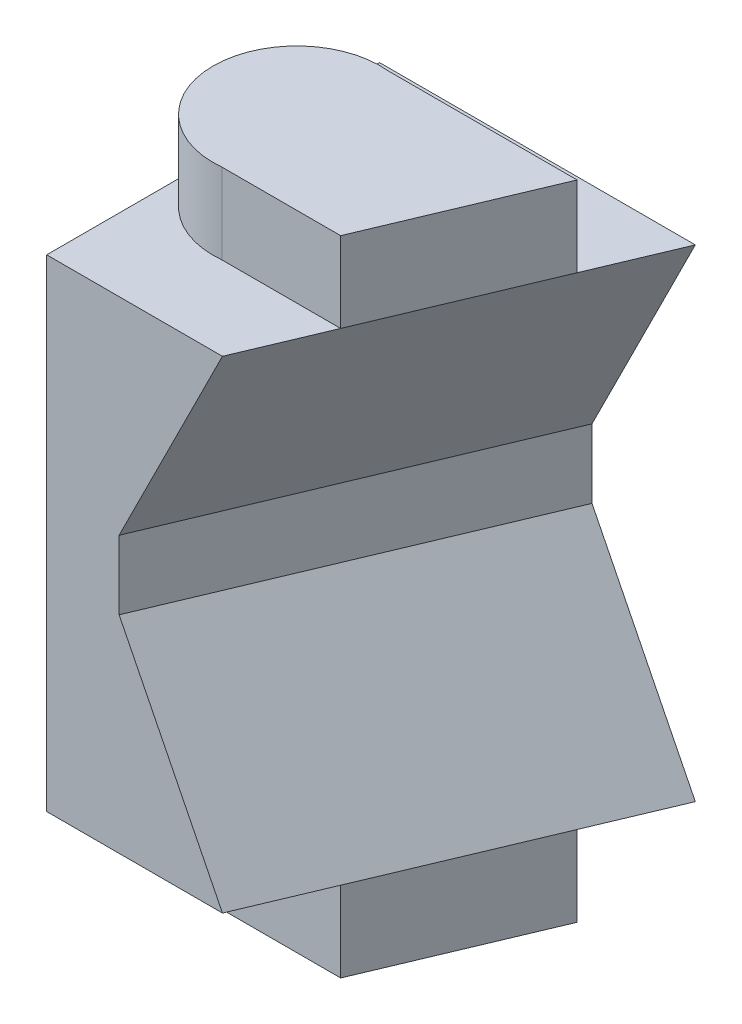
ISO-10303-21;
HEADER;
FILE_DESCRIPTION(('STEP AP214'),'2;1');
FILE_NAME('part.step','',(''),(''),'','','');
FILE_SCHEMA(('AUTOMOTIVE_DESIGN { 1 0 10303 214 1 1 1 1 }'));
ENDSEC;
DATA;
#1=APPLICATION_CONTEXT('core data for automotive mechanical design processes');
#2=APPLICATION_PROTOCOL_DEFINITION('international standard','automotive_design',2000,#1);
#3=PRODUCT_CONTEXT('',#1,'mechanical');
#4=PRODUCT('Part','Part','',(#3));
#5=PRODUCT_RELATED_PRODUCT_CATEGORY('part','',(#4));
#6=PRODUCT_DEFINITION_FORMATION('','',#4);
#7=PRODUCT_DEFINITION_CONTEXT('part definition',#1,'design');
#8=PRODUCT_DEFINITION('design','',#6,#7);
#9=PRODUCT_DEFINITION_SHAPE('','',#8);
#10=(LENGTH_UNIT() NAMED_UNIT(*) SI_UNIT(.MILLI.,.METRE.));
#11=(NAMED_UNIT(*) PLANE_ANGLE_UNIT() SI_UNIT($,.RADIAN.));
#12=(NAMED_UNIT(*) SI_UNIT($,.STERADIAN.) SOLID_ANGLE_UNIT());
#13=UNCERTAINTY_MEASURE_WITH_UNIT(LENGTH_MEASURE(1.E-05),#10,'distance_accuracy_value','');
#14=(GEOMETRIC_REPRESENTATION_CONTEXT(3) GLOBAL_UNCERTAINTY_ASSIGNED_CONTEXT((#13)) GLOBAL_UNIT_ASSIGNED_CONTEXT((#10,
#11,#12)) REPRESENTATION_CONTEXT('',''));
#15=CARTESIAN_POINT('',(0.,0.,0.));
#16=DIRECTION('',(0.,0.,1.));
#17=DIRECTION('',(1.,0.,0.));
#18=AXIS2_PLACEMENT_3D('',#15,#16,#17);
#19=CARTESIAN_POINT('',(27.5,-21.0000000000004,0.));
#20=DIRECTION('',(0.,1.00000000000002,0.));
#21=DIRECTION('',(0.,0.,1.00000000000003));
#22=AXIS2_PLACEMENT_3D('',#19,#20,#21);
#23=PLANE('',#22);
#24=CARTESIAN_POINT('',(7.2856942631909,-21.0000000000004,14.5000000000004));
#25=DIRECTION('',(0.,1.,0.));
#26=DIRECTION('',(0.,0.,-1.));
#27=AXIS2_PLACEMENT_3D('',#24,#25,#26);
#28=CIRCLE('',#27,7.28569426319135);
#29=CARTESIAN_POINT('',(-4.5102810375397E-13,-21.0000000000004,14.5000000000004));
#30=VERTEX_POINT('',#29);
#31=CARTESIAN_POINT('',(8.00600037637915,-21.0000000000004,21.7500000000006));
#32=VERTEX_POINT('',#31);
#33=EDGE_CURVE('E9',#30,#32,#28,.T.);
#34=ORIENTED_EDGE('',*,*,#33,.T.);
#35=DIRECTION('',(1.,0.,0.));
#36=VECTOR('',#35,1.);
#37=CARTESIAN_POINT('',(8.00600037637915,-21.0000000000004,21.7500000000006));
#38=LINE('',#37,#36);
#39=CARTESIAN_POINT('',(18.3571418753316,-21.0000000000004,21.7500000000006));
#40=VERTEX_POINT('',#39);
#41=EDGE_CURVE('E166',#32,#40,#38,.T.);
#42=ORIENTED_EDGE('',*,*,#41,.T.);
#43=DIRECTION('',(0.387515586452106,0.,-0.921863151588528));
#44=VECTOR('',#43,1.);
#45=CARTESIAN_POINT('',(15.3095225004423,-21.0000000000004,29.0000000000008));
#46=LINE('',#45,#44);
#47=CARTESIAN_POINT('',(15.3095225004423,-21.0000000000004,29.0000000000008));
#48=VERTEX_POINT('',#47);
#49=EDGE_CURVE('E209',#48,#40,#46,.T.);
#50=ORIENTED_EDGE('',*,*,#49,.F.);
#51=DIRECTION('',(1.00000000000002,0.,0.));
#52=VECTOR('',#51,1.);
#53=CARTESIAN_POINT('',(-4.5102810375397E-13,-21.0000000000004,29.0000000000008));
#54=LINE('',#53,#52);
#55=CARTESIAN_POINT('',(0.,-21.0000000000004,29.0000000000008));
#56=VERTEX_POINT('',#55);
#57=EDGE_CURVE('E208',#56,#48,#54,.T.);
#58=ORIENTED_EDGE('',*,*,#57,.F.);
#59=DIRECTION('',(0.,0.,-1.));
#60=VECTOR('',#59,1.);
#61=CARTESIAN_POINT('',(0.,-21.0000000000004,14.5000000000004));
#62=LINE('',#61,#60);
#63=EDGE_CURVE('E130',#56,#30,#62,.T.);
#64=ORIENTED_EDGE('',*,*,#63,.T.);
#65=EDGE_LOOP('',(#34,#42,#50,#58,#64));
#66=FACE_BOUND('',#65,.T.);
#67=ADVANCED_FACE('F14',(#66),#23,.F.);
#68=CARTESIAN_POINT('',(-4.5102810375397E-13,21.0000000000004,29.0000000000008));
#69=DIRECTION('',(0.,1.00000000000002,0.));
#70=DIRECTION('',(0.,0.,1.00000000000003));
#71=AXIS2_PLACEMENT_3D('',#68,#69,#70);
#72=PLANE('',#71);
#73=DIRECTION('',(-1.,0.,0.));
#74=VECTOR('',#73,1.);
#75=CARTESIAN_POINT('',(8.00600037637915,21.0000000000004,7.2500000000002));
#76=LINE('',#75,#74);
#77=CARTESIAN_POINT('',(24.452380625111,21.0000000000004,7.24999999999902));
#78=VERTEX_POINT('',#77);
#79=CARTESIAN_POINT('',(8.00600037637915,21.0000000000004,7.2500000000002));
#80=VERTEX_POINT('',#79);
#81=EDGE_CURVE('E186',#78,#80,#76,.T.);
#82=ORIENTED_EDGE('',*,*,#81,.F.);
#83=DIRECTION('',(0.387515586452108,0.,-0.921863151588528));
#84=VECTOR('',#83,1.);
#85=CARTESIAN_POINT('',(15.3095225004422,21.0000000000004,29.0000000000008));
#86=LINE('',#85,#84);
#87=CARTESIAN_POINT('',(27.5,21.0000000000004,0.));
#88=VERTEX_POINT('',#87);
#89=EDGE_CURVE('E224',#78,#88,#86,.T.);
#90=ORIENTED_EDGE('',*,*,#89,.T.);
#91=DIRECTION('',(-1.00000000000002,0.,0.));
#92=VECTOR('',#91,1.);
#93=CARTESIAN_POINT('',(27.5,21.0000000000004,0.));
#94=LINE('',#93,#92);
#95=CARTESIAN_POINT('',(0.,21.0000000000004,0.));
#96=VERTEX_POINT('',#95);
#97=EDGE_CURVE('E125',#88,#96,#94,.T.);
#98=ORIENTED_EDGE('',*,*,#97,.T.);
#99=DIRECTION('',(0.,0.,1.));
#100=VECTOR('',#99,1.);
#101=CARTESIAN_POINT('',(0.,21.0000000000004,14.5000000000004));
#102=LINE('',#101,#100);
#103=CARTESIAN_POINT('',(0.,21.0000000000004,14.5000000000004));
#104=VERTEX_POINT('',#103);
#105=EDGE_CURVE('E122',#96,#104,#102,.T.);
#106=ORIENTED_EDGE('',*,*,#105,.T.);
#107=CARTESIAN_POINT('',(7.2856942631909,21.0000000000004,14.5000000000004));
#108=DIRECTION('',(0.,1.,0.));
#109=DIRECTION('',(0.,0.,-1.));
#110=AXIS2_PLACEMENT_3D('',#107,#108,#109);
#111=CIRCLE('',#110,7.28569426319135);
#112=EDGE_CURVE('E39',#80,#104,#111,.T.);
#113=ORIENTED_EDGE('',*,*,#112,.F.);
#114=EDGE_LOOP('',(#82,#90,#98,#106,#113));
#115=FACE_BOUND('',#114,.T.);
#116=ADVANCED_FACE('F123',(#115),#72,.T.);
#117=CARTESIAN_POINT('',(8.00600037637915,21.0000000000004,21.7500000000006));
#118=VERTEX_POINT('',#117);
#119=EDGE_CURVE('E23',#104,#118,#111,.T.);
#120=ORIENTED_EDGE('',*,*,#119,.F.);
#121=DIRECTION('',(0.,0.,1.));
#122=VECTOR('',#121,1.);
#123=CARTESIAN_POINT('',(0.,21.0000000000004,14.5000000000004));
#124=LINE('',#123,#122);
#125=CARTESIAN_POINT('',(0.,21.0000000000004,29.0000000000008));
#126=VERTEX_POINT('',#125);
#127=EDGE_CURVE('E149',#104,#126,#124,.T.);
#128=ORIENTED_EDGE('',*,*,#127,.T.);
#129=DIRECTION('',(1.00000000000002,0.,0.));
#130=VECTOR('',#129,1.);
#131=CARTESIAN_POINT('',(-4.5102810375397E-13,21.0000000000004,29.0000000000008));
#132=LINE('',#131,#130);
#133=CARTESIAN_POINT('',(15.3095225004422,21.0000000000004,29.0000000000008));
#134=VERTEX_POINT('',#133);
#135=EDGE_CURVE('E220',#126,#134,#132,.T.);
#136=ORIENTED_EDGE('',*,*,#135,.T.);
#137=CARTESIAN_POINT('',(18.3571418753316,21.0000000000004,21.7500000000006));
#138=VERTEX_POINT('',#137);
#139=EDGE_CURVE('E223',#134,#138,#86,.T.);
#140=ORIENTED_EDGE('',*,*,#139,.T.);
#141=DIRECTION('',(1.,0.,0.));
#142=VECTOR('',#141,1.);
#143=CARTESIAN_POINT('',(8.00600037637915,21.0000000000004,21.7500000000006));
#144=LINE('',#143,#142);
#145=EDGE_CURVE('E143',#118,#138,#144,.T.);
#146=ORIENTED_EDGE('',*,*,#145,.F.);
#147=EDGE_LOOP('',(#120,#128,#136,#140,#146));
#148=FACE_BOUND('',#147,.T.);
#149=ADVANCED_FACE('F148',(#148),#72,.T.);
#150=CARTESIAN_POINT('',(-4.5102810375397E-13,3.00000000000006,29.0000000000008));
#151=DIRECTION('',(0.,0.,1.00000000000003));
#152=DIRECTION('',(1.00000000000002,0.,0.));
#153=AXIS2_PLACEMENT_3D('',#150,#151,#152);
#154=PLANE('',#153);
#155=ORIENTED_EDGE('',*,*,#135,.F.);
#156=DIRECTION('',(0.,-1.,0.));
#157=VECTOR('',#156,1.);
#158=CARTESIAN_POINT('',(0.,21.0000000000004,29.0000000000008));
#159=LINE('',#158,#157);
#160=EDGE_CURVE('E156',#126,#56,#159,.T.);
#161=ORIENTED_EDGE('',*,*,#160,.T.);
#162=ORIENTED_EDGE('',*,*,#57,.T.);
#163=DIRECTION('',(-0.447213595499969,0.894427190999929,0.));
#164=VECTOR('',#163,1.);
#165=CARTESIAN_POINT('',(15.3095225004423,-21.0000000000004,29.0000000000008));
#166=LINE('',#165,#164);
#167=CARTESIAN_POINT('',(6.309522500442,-3.00000000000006,29.0000000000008));
#168=VERTEX_POINT('',#167);
#169=EDGE_CURVE('E202',#48,#168,#166,.T.);
#170=ORIENTED_EDGE('',*,*,#169,.T.);
#171=DIRECTION('',(0.,1.00000000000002,0.));
#172=VECTOR('',#171,1.);
#173=CARTESIAN_POINT('',(6.309522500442,-3.00000000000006,29.0000000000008));
#174=LINE('',#173,#172);
#175=CARTESIAN_POINT('',(6.309522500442,3.00000000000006,29.0000000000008));
#176=VERTEX_POINT('',#175);
#177=EDGE_CURVE('E216',#168,#176,#174,.T.);
#178=ORIENTED_EDGE('',*,*,#177,.T.);
#179=DIRECTION('',(0.447213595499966,0.894427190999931,0.));
#180=VECTOR('',#179,1.);
#181=CARTESIAN_POINT('',(6.309522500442,3.00000000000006,29.0000000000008));
#182=LINE('',#181,#180);
#183=EDGE_CURVE('E229',#176,#134,#182,.T.);
#184=ORIENTED_EDGE('',*,*,#183,.T.);
#185=EDGE_LOOP('',(#155,#161,#162,#170,#178,#184));
#186=FACE_BOUND('',#185,.T.);
#187=ADVANCED_FACE('F16',(#186),#154,.T.);
#188=CARTESIAN_POINT('',(18.5,3.00000000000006,0.));
#189=DIRECTION('',(0.,0.,-1.00000000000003));
#190=DIRECTION('',(-1.00000000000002,0.,0.));
#191=AXIS2_PLACEMENT_3D('',#188,#189,#190);
#192=PLANE('',#191);
#193=DIRECTION('',(-1.00000000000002,0.,0.));
#194=VECTOR('',#193,1.);
#195=CARTESIAN_POINT('',(27.5,-21.0000000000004,0.));
#196=LINE('',#195,#194);
#197=CARTESIAN_POINT('',(27.5,-21.0000000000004,0.));
#198=VERTEX_POINT('',#197);
#199=CARTESIAN_POINT('',(0.,-21.0000000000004,0.));
#200=VERTEX_POINT('',#199);
#201=EDGE_CURVE('E206',#198,#200,#196,.T.);
#202=ORIENTED_EDGE('',*,*,#201,.T.);
#203=DIRECTION('',(0.,1.,0.));
#204=VECTOR('',#203,1.);
#205=CARTESIAN_POINT('',(0.,-21.0000000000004,0.));
#206=LINE('',#205,#204);
#207=EDGE_CURVE('E280',#200,#96,#206,.T.);
#208=ORIENTED_EDGE('',*,*,#207,.T.);
#209=ORIENTED_EDGE('',*,*,#97,.F.);
#210=DIRECTION('',(0.447213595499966,0.894427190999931,0.));
#211=VECTOR('',#210,1.);
#212=CARTESIAN_POINT('',(18.5,3.00000000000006,0.));
#213=LINE('',#212,#211);
#214=CARTESIAN_POINT('',(18.5,3.00000000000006,0.));
#215=VERTEX_POINT('',#214);
#216=EDGE_CURVE('E222',#215,#88,#213,.T.);
#217=ORIENTED_EDGE('',*,*,#216,.F.);
#218=DIRECTION('',(0.,1.00000000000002,0.));
#219=VECTOR('',#218,1.);
#220=CARTESIAN_POINT('',(18.5,-3.00000000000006,0.));
#221=LINE('',#220,#219);
#222=CARTESIAN_POINT('',(18.5,-3.00000000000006,0.));
#223=VERTEX_POINT('',#222);
#224=EDGE_CURVE('E218',#223,#215,#221,.T.);
#225=ORIENTED_EDGE('',*,*,#224,.F.);
#226=DIRECTION('',(-0.447213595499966,0.894427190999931,0.));
#227=VECTOR('',#226,1.);
#228=CARTESIAN_POINT('',(27.5,-21.0000000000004,0.));
#229=LINE('',#228,#227);
#230=EDGE_CURVE('E198',#198,#223,#229,.T.);
#231=ORIENTED_EDGE('',*,*,#230,.F.);
#232=EDGE_LOOP('',(#202,#208,#209,#217,#225,#231));
#233=FACE_BOUND('',#232,.T.);
#234=ADVANCED_FACE('F272',(#233),#192,.T.);
#235=DIRECTION('',(-1.,0.,0.));
#236=VECTOR('',#235,1.);
#237=CARTESIAN_POINT('',(8.00600037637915,-21.0000000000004,7.2500000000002));
#238=LINE('',#237,#236);
#239=CARTESIAN_POINT('',(24.4523806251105,-21.0000000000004,7.2500000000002));
#240=VERTEX_POINT('',#239);
#241=CARTESIAN_POINT('',(8.00600037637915,-21.0000000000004,7.2500000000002));
#242=VERTEX_POINT('',#241);
#243=EDGE_CURVE('E158',#240,#242,#238,.T.);
#244=ORIENTED_EDGE('',*,*,#243,.T.);
#245=EDGE_CURVE('E25',#242,#30,#28,.T.);
#246=ORIENTED_EDGE('',*,*,#245,.T.);
#247=DIRECTION('',(0.,0.,-1.));
#248=VECTOR('',#247,1.);
#249=CARTESIAN_POINT('',(0.,-21.0000000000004,14.5000000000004));
#250=LINE('',#249,#248);
#251=EDGE_CURVE('E131',#30,#200,#250,.T.);
#252=ORIENTED_EDGE('',*,*,#251,.T.);
#253=ORIENTED_EDGE('',*,*,#201,.F.);
#254=EDGE_CURVE('E205',#240,#198,#46,.T.);
#255=ORIENTED_EDGE('',*,*,#254,.F.);
#256=EDGE_LOOP('',(#244,#246,#252,#253,#255));
#257=FACE_BOUND('',#256,.T.);
#258=ADVANCED_FACE('F268',(#257),#23,.F.);
#259=CARTESIAN_POINT('',(6.309522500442,3.00000000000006,29.0000000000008));
#260=DIRECTION('',(0.837207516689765,-0.418603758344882,0.351929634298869));
#261=DIRECTION('',(0.447213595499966,0.894427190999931,0.));
#262=AXIS2_PLACEMENT_3D('',#259,#260,#261);
#263=PLANE('',#262);
#264=DIRECTION('',(0.387515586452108,0.,-0.921863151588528));
#265=VECTOR('',#264,1.);
#266=CARTESIAN_POINT('',(6.309522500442,3.00000000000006,29.0000000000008));
#267=LINE('',#266,#265);
#268=EDGE_CURVE('E152',#176,#215,#267,.T.);
#269=ORIENTED_EDGE('',*,*,#268,.T.);
#270=ORIENTED_EDGE('',*,*,#216,.T.);
#271=ORIENTED_EDGE('',*,*,#89,.F.);
#272=DIRECTION('',(0.387515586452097,0.,-0.921863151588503));
#273=VECTOR('',#272,1.);
#274=CARTESIAN_POINT('',(18.3571418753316,21.0000000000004,21.7500000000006));
#275=LINE('',#274,#273);
#276=EDGE_CURVE('E193',#138,#78,#275,.T.);
#277=ORIENTED_EDGE('',*,*,#276,.F.);
#278=ORIENTED_EDGE('',*,*,#139,.F.);
#279=ORIENTED_EDGE('',*,*,#183,.F.);
#280=EDGE_LOOP('',(#269,#270,#271,#277,#278,#279));
#281=FACE_BOUND('',#280,.T.);
#282=ADVANCED_FACE('F306',(#281),#263,.T.);
#283=CARTESIAN_POINT('',(18.5,-3.00000000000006,0.));
#284=DIRECTION('',(-0.921863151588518,0.,-0.387515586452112));
#285=DIRECTION('',(-0.387515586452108,0.,0.921863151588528));
#286=AXIS2_PLACEMENT_3D('',#283,#284,#285);
#287=PLANE('',#286);
#288=ORIENTED_EDGE('',*,*,#177,.F.);
#289=DIRECTION('',(-0.387515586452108,0.,0.921863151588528));
#290=VECTOR('',#289,1.);
#291=CARTESIAN_POINT('',(18.5,-3.00000000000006,0.));
#292=LINE('',#291,#290);
#293=EDGE_CURVE('E211',#223,#168,#292,.T.);
#294=ORIENTED_EDGE('',*,*,#293,.F.);
#295=ORIENTED_EDGE('',*,*,#224,.T.);
#296=ORIENTED_EDGE('',*,*,#268,.F.);
#297=EDGE_LOOP('',(#288,#294,#295,#296));
#298=FACE_BOUND('',#297,.T.);
#299=ADVANCED_FACE('F276',(#298),#287,.F.);
#300=CARTESIAN_POINT('',(15.3095225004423,-21.0000000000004,29.0000000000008));
#301=DIRECTION('',(0.837207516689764,0.418603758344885,0.351929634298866));
#302=DIRECTION('',(-0.447213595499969,0.894427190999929,0.));
#303=AXIS2_PLACEMENT_3D('',#300,#301,#302);
#304=PLANE('',#303);
#305=ORIENTED_EDGE('',*,*,#49,.T.);
#306=DIRECTION('',(0.387515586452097,0.,-0.921863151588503));
#307=VECTOR('',#306,1.);
#308=CARTESIAN_POINT('',(18.3571418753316,-21.0000000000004,21.7500000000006));
#309=LINE('',#308,#307);
#310=EDGE_CURVE('E178',#40,#240,#309,.T.);
#311=ORIENTED_EDGE('',*,*,#310,.T.);
#312=ORIENTED_EDGE('',*,*,#254,.T.);
#313=ORIENTED_EDGE('',*,*,#230,.T.);
#314=ORIENTED_EDGE('',*,*,#293,.T.);
#315=ORIENTED_EDGE('',*,*,#169,.F.);
#316=EDGE_LOOP('',(#305,#311,#312,#313,#314,#315));
#317=FACE_BOUND('',#316,.T.);
#318=ADVANCED_FACE('F246',(#317),#304,.T.);
#319=CARTESIAN_POINT('',(7.2856942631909,28.0000000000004,14.5000000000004));
#320=DIRECTION('',(0.,-1.,0.));
#321=DIRECTION('',(0.,0.,-1.));
#322=AXIS2_PLACEMENT_3D('',#319,#320,#321);
#323=CYLINDRICAL_SURFACE('',#322,7.28569426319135);
#324=ORIENTED_EDGE('',*,*,#112,.T.);
#325=ORIENTED_EDGE('',*,*,#119,.T.);
#326=DIRECTION('',(0.,-1.,0.));
#327=VECTOR('',#326,1.);
#328=CARTESIAN_POINT('',(8.00600037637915,28.0000000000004,21.7500000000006));
#329=LINE('',#328,#327);
#330=CARTESIAN_POINT('',(8.00600037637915,28.0000000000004,21.7500000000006));
#331=VERTEX_POINT('',#330);
#332=EDGE_CURVE('E196',#331,#118,#329,.T.);
#333=ORIENTED_EDGE('',*,*,#332,.F.);
#334=CARTESIAN_POINT('',(7.2856942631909,28.0000000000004,14.5000000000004));
#335=DIRECTION('',(0.,1.,0.));
#336=DIRECTION('',(0.,0.,-1.));
#337=AXIS2_PLACEMENT_3D('',#334,#335,#336);
#338=CIRCLE('',#337,7.28569426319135);
#339=CARTESIAN_POINT('',(8.00600037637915,28.0000000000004,7.2500000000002));
#340=VERTEX_POINT('',#339);
#341=EDGE_CURVE('E182',#340,#331,#338,.T.);
#342=ORIENTED_EDGE('',*,*,#341,.F.);
#343=DIRECTION('',(0.,-1.,0.));
#344=VECTOR('',#343,1.);
#345=CARTESIAN_POINT('',(8.00600037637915,28.0000000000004,7.2500000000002));
#346=LINE('',#345,#344);
#347=EDGE_CURVE('E142',#340,#80,#346,.T.);
#348=ORIENTED_EDGE('',*,*,#347,.T.);
#349=EDGE_LOOP('',(#324,#325,#333,#342,#348));
#350=FACE_BOUND('',#349,.T.);
#351=ADVANCED_FACE('F137',(#350),#323,.T.);
#352=CARTESIAN_POINT('',(8.00600037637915,28.0000000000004,21.7500000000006));
#353=DIRECTION('',(0.,0.,-1.));
#354=DIRECTION('',(-1.,0.,0.));
#355=AXIS2_PLACEMENT_3D('',#352,#353,#354);
#356=PLANE('',#355);
#357=ORIENTED_EDGE('',*,*,#145,.T.);
#358=DIRECTION('',(0.,-1.,0.));
#359=VECTOR('',#358,1.);
#360=CARTESIAN_POINT('',(18.3571418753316,28.0000000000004,21.7500000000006));
#361=LINE('',#360,#359);
#362=CARTESIAN_POINT('',(18.3571418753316,28.0000000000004,21.7500000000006));
#363=VERTEX_POINT('',#362);
#364=EDGE_CURVE('E199',#363,#138,#361,.T.);
#365=ORIENTED_EDGE('',*,*,#364,.F.);
#366=DIRECTION('',(1.,0.,0.));
#367=VECTOR('',#366,1.);
#368=CARTESIAN_POINT('',(8.00600037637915,28.0000000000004,21.7500000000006));
#369=LINE('',#368,#367);
#370=EDGE_CURVE('E185',#331,#363,#369,.T.);
#371=ORIENTED_EDGE('',*,*,#370,.F.);
#372=ORIENTED_EDGE('',*,*,#332,.T.);
#373=EDGE_LOOP('',(#357,#365,#371,#372));
#374=FACE_BOUND('',#373,.T.);
#375=ADVANCED_FACE('F328',(#374),#356,.F.);
#376=CARTESIAN_POINT('',(18.3571418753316,28.0000000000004,21.7500000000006));
#377=DIRECTION('',(-0.921863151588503,0.,-0.387515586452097));
#378=DIRECTION('',(-0.387515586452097,0.,0.921863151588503));
#379=AXIS2_PLACEMENT_3D('',#376,#377,#378);
#380=PLANE('',#379);
#381=ORIENTED_EDGE('',*,*,#276,.T.);
#382=DIRECTION('',(0.,-1.,0.));
#383=VECTOR('',#382,1.);
#384=CARTESIAN_POINT('',(24.4523806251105,28.0000000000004,7.2500000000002));
#385=LINE('',#384,#383);
#386=CARTESIAN_POINT('',(24.4523806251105,28.0000000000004,7.2500000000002));
#387=VERTEX_POINT('',#386);
#388=EDGE_CURVE('E195',#387,#78,#385,.T.);
#389=ORIENTED_EDGE('',*,*,#388,.F.);
#390=DIRECTION('',(0.387515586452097,0.,-0.921863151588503));
#391=VECTOR('',#390,1.);
#392=CARTESIAN_POINT('',(18.3571418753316,28.0000000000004,21.7500000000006));
#393=LINE('',#392,#391);
#394=EDGE_CURVE('E188',#363,#387,#393,.T.);
#395=ORIENTED_EDGE('',*,*,#394,.F.);
#396=ORIENTED_EDGE('',*,*,#364,.T.);
#397=EDGE_LOOP('',(#381,#389,#395,#396));
#398=FACE_BOUND('',#397,.T.);
#399=ADVANCED_FACE('F333',(#398),#380,.F.);
#400=CARTESIAN_POINT('',(8.00600037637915,28.0000000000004,7.2500000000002));
#401=DIRECTION('',(0.,0.,1.));
#402=DIRECTION('',(1.,0.,0.));
#403=AXIS2_PLACEMENT_3D('',#400,#401,#402);
#404=PLANE('',#403);
#405=ORIENTED_EDGE('',*,*,#81,.T.);
#406=ORIENTED_EDGE('',*,*,#347,.F.);
#407=DIRECTION('',(-1.,0.,0.));
#408=VECTOR('',#407,1.);
#409=CARTESIAN_POINT('',(8.00600037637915,28.0000000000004,7.2500000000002));
#410=LINE('',#409,#408);
#411=EDGE_CURVE('E190',#387,#340,#410,.T.);
#412=ORIENTED_EDGE('',*,*,#411,.F.);
#413=ORIENTED_EDGE('',*,*,#388,.T.);
#414=EDGE_LOOP('',(#405,#406,#412,#413));
#415=FACE_BOUND('',#414,.T.);
#416=ADVANCED_FACE('F293',(#415),#404,.F.);
#417=CARTESIAN_POINT('',(7.2856942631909,28.0000000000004,14.5000000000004));
#418=DIRECTION('',(0.,-1.,0.));
#419=DIRECTION('',(0.,0.,-1.));
#420=AXIS2_PLACEMENT_3D('',#417,#418,#419);
#421=PLANE('',#420);
#422=ORIENTED_EDGE('',*,*,#341,.T.);
#423=ORIENTED_EDGE('',*,*,#370,.T.);
#424=ORIENTED_EDGE('',*,*,#394,.T.);
#425=ORIENTED_EDGE('',*,*,#411,.T.);
#426=EDGE_LOOP('',(#422,#423,#424,#425));
#427=FACE_BOUND('',#426,.T.);
#428=ADVANCED_FACE('F284',(#427),#421,.F.);
#429=CARTESIAN_POINT('',(7.2856942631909,-28.0000000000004,14.5000000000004));
#430=DIRECTION('',(0.,1.,0.));
#431=DIRECTION('',(0.,0.,1.));
#432=AXIS2_PLACEMENT_3D('',#429,#430,#431);
#433=CYLINDRICAL_SURFACE('',#432,7.28569426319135);
#434=ORIENTED_EDGE('',*,*,#245,.F.);
#435=DIRECTION('',(0.,1.,0.));
#436=VECTOR('',#435,1.);
#437=CARTESIAN_POINT('',(8.00600037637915,-28.0000000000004,7.2500000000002));
#438=LINE('',#437,#436);
#439=CARTESIAN_POINT('',(8.00600037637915,-28.0000000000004,7.2500000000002));
#440=VERTEX_POINT('',#439);
#441=EDGE_CURVE('E144',#440,#242,#438,.T.);
#442=ORIENTED_EDGE('',*,*,#441,.F.);
#443=CARTESIAN_POINT('',(7.2856942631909,-28.0000000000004,14.5000000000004));
#444=DIRECTION('',(0.,1.,0.));
#445=DIRECTION('',(0.,0.,-1.));
#446=AXIS2_PLACEMENT_3D('',#443,#444,#445);
#447=CIRCLE('',#446,7.28569426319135);
#448=CARTESIAN_POINT('',(8.00600037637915,-28.0000000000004,21.7500000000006));
#449=VERTEX_POINT('',#448);
#450=EDGE_CURVE('E162',#440,#449,#447,.T.);
#451=ORIENTED_EDGE('',*,*,#450,.T.);
#452=DIRECTION('',(0.,1.,0.));
#453=VECTOR('',#452,1.);
#454=CARTESIAN_POINT('',(8.00600037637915,-28.0000000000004,21.7500000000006));
#455=LINE('',#454,#453);
#456=EDGE_CURVE('E174',#449,#32,#455,.T.);
#457=ORIENTED_EDGE('',*,*,#456,.T.);
#458=ORIENTED_EDGE('',*,*,#33,.F.);
#459=EDGE_LOOP('',(#434,#442,#451,#457,#458));
#460=FACE_BOUND('',#459,.T.);
#461=ADVANCED_FACE('F282',(#460),#433,.T.);
#462=CARTESIAN_POINT('',(8.00600037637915,-28.0000000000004,7.2500000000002));
#463=DIRECTION('',(0.,0.,-1.));
#464=DIRECTION('',(-1.,0.,0.));
#465=AXIS2_PLACEMENT_3D('',#462,#463,#464);
#466=PLANE('',#465);
#467=ORIENTED_EDGE('',*,*,#243,.F.);
#468=DIRECTION('',(0.,1.,0.));
#469=VECTOR('',#468,1.);
#470=CARTESIAN_POINT('',(24.4523806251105,-28.0000000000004,7.2500000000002));
#471=LINE('',#470,#469);
#472=CARTESIAN_POINT('',(24.4523806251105,-28.0000000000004,7.2500000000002));
#473=VERTEX_POINT('',#472);
#474=EDGE_CURVE('E181',#473,#240,#471,.T.);
#475=ORIENTED_EDGE('',*,*,#474,.F.);
#476=DIRECTION('',(-1.,0.,0.));
#477=VECTOR('',#476,1.);
#478=CARTESIAN_POINT('',(8.00600037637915,-28.0000000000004,7.2500000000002));
#479=LINE('',#478,#477);
#480=EDGE_CURVE('E165',#473,#440,#479,.T.);
#481=ORIENTED_EDGE('',*,*,#480,.T.);
#482=ORIENTED_EDGE('',*,*,#441,.T.);
#483=EDGE_LOOP('',(#467,#475,#481,#482));
#484=FACE_BOUND('',#483,.T.);
#485=ADVANCED_FACE('F266',(#484),#466,.T.);
#486=CARTESIAN_POINT('',(18.3571418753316,-28.0000000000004,21.7500000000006));
#487=DIRECTION('',(0.921863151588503,0.,0.387515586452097));
#488=DIRECTION('',(0.387515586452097,0.,-0.921863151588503));
#489=AXIS2_PLACEMENT_3D('',#486,#487,#488);
#490=PLANE('',#489);
#491=ORIENTED_EDGE('',*,*,#310,.F.);
#492=DIRECTION('',(0.,1.,0.));
#493=VECTOR('',#492,1.);
#494=CARTESIAN_POINT('',(18.3571418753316,-28.0000000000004,21.7500000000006));
#495=LINE('',#494,#493);
#496=CARTESIAN_POINT('',(18.3571418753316,-28.0000000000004,21.7500000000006));
#497=VERTEX_POINT('',#496);
#498=EDGE_CURVE('E18',#497,#40,#495,.T.);
#499=ORIENTED_EDGE('',*,*,#498,.F.);
#500=DIRECTION('',(0.387515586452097,0.,-0.921863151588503));
#501=VECTOR('',#500,1.);
#502=CARTESIAN_POINT('',(18.3571418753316,-28.0000000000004,21.7500000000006));
#503=LINE('',#502,#501);
#504=EDGE_CURVE('E169',#497,#473,#503,.T.);
#505=ORIENTED_EDGE('',*,*,#504,.T.);
#506=ORIENTED_EDGE('',*,*,#474,.T.);
#507=EDGE_LOOP('',(#491,#499,#505,#506));
#508=FACE_BOUND('',#507,.T.);
#509=ADVANCED_FACE('F252',(#508),#490,.T.);
#510=CARTESIAN_POINT('',(8.00600037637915,-28.0000000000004,21.7500000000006));
#511=DIRECTION('',(0.,0.,1.));
#512=DIRECTION('',(1.,0.,0.));
#513=AXIS2_PLACEMENT_3D('',#510,#511,#512);
#514=PLANE('',#513);
#515=ORIENTED_EDGE('',*,*,#41,.F.);
#516=ORIENTED_EDGE('',*,*,#456,.F.);
#517=DIRECTION('',(1.,0.,0.));
#518=VECTOR('',#517,1.);
#519=CARTESIAN_POINT('',(8.00600037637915,-28.0000000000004,21.7500000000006));
#520=LINE('',#519,#518);
#521=EDGE_CURVE('E172',#449,#497,#520,.T.);
#522=ORIENTED_EDGE('',*,*,#521,.T.);
#523=ORIENTED_EDGE('',*,*,#498,.T.);
#524=EDGE_LOOP('',(#515,#516,#522,#523));
#525=FACE_BOUND('',#524,.T.);
#526=ADVANCED_FACE('F259',(#525),#514,.T.);
#527=CARTESIAN_POINT('',(7.2856942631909,-28.0000000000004,14.5000000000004));
#528=DIRECTION('',(0.,1.,0.));
#529=DIRECTION('',(0.,0.,-1.));
#530=AXIS2_PLACEMENT_3D('',#527,#528,#529);
#531=PLANE('',#530);
#532=ORIENTED_EDGE('',*,*,#450,.F.);
#533=ORIENTED_EDGE('',*,*,#480,.F.);
#534=ORIENTED_EDGE('',*,*,#504,.F.);
#535=ORIENTED_EDGE('',*,*,#521,.F.);
#536=EDGE_LOOP('',(#532,#533,#534,#535));
#537=FACE_BOUND('',#536,.T.);
#538=ADVANCED_FACE('F263',(#537),#531,.F.);
#539=CARTESIAN_POINT('',(0.,21.0000000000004,29.0000000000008));
#540=DIRECTION('',(1.,0.,0.));
#541=DIRECTION('',(0.,0.,-1.));
#542=AXIS2_PLACEMENT_3D('',#539,#540,#541);
#543=PLANE('',#542);
#544=ORIENTED_EDGE('',*,*,#127,.F.);
#545=ORIENTED_EDGE('',*,*,#105,.F.);
#546=ORIENTED_EDGE('',*,*,#207,.F.);
#547=ORIENTED_EDGE('',*,*,#251,.F.);
#548=ORIENTED_EDGE('',*,*,#63,.F.);
#549=ORIENTED_EDGE('',*,*,#160,.F.);
#550=EDGE_LOOP('',(#544,#545,#546,#547,#548,#549));
#551=FACE_BOUND('',#550,.T.);
#552=ADVANCED_FACE('F153',(#551),#543,.F.);
#553=CLOSED_SHELL('',(#67,#116,#149,#187,#234,#258,#282,#299,#318,#351,#375,#399,#416,#428,#461,
#485,#509,#526,#538,#552));
#554=MANIFOLD_SOLID_BREP('B1',#553);
#555=ADVANCED_BREP_SHAPE_REPRESENTATION('',(#18,#554),#14);
#556=SHAPE_DEFINITION_REPRESENTATION(#9,#555);
ENDSEC;
END-ISO-10303-21;
